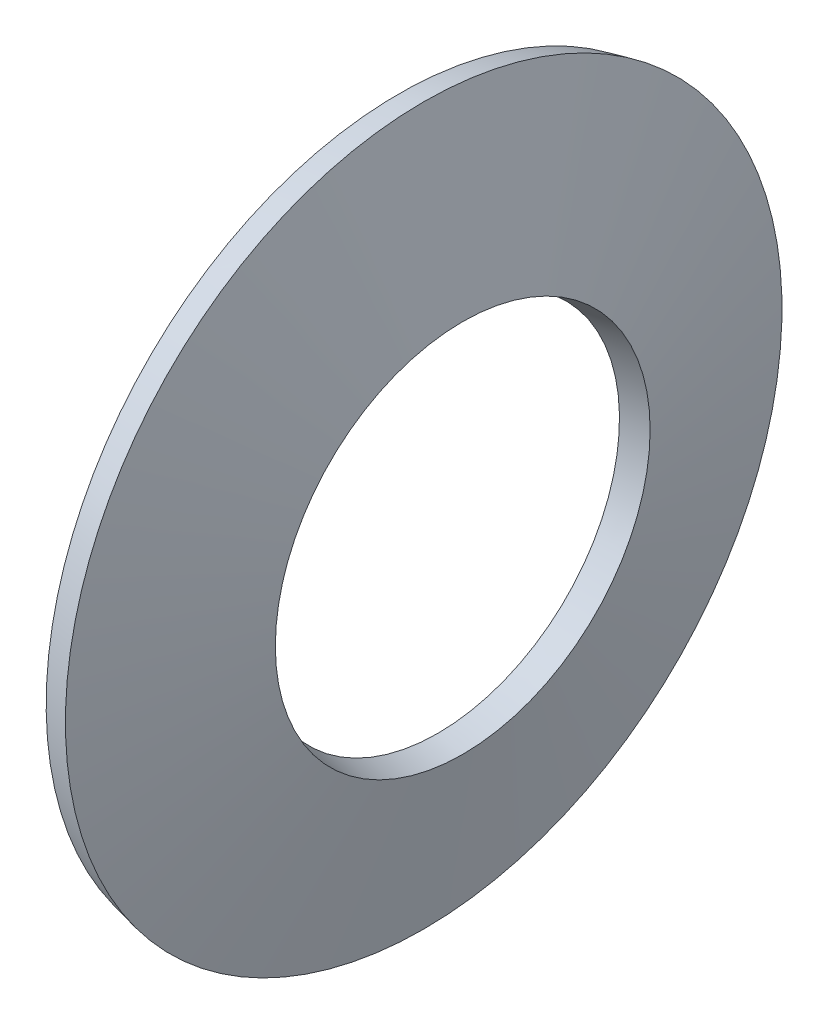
from build123d import *


with BuildPart() as part:
    # Esquisse2 → Base-R_volution (revolve)
    with BuildSketch(Plane.XY, mode=Mode.PRIVATE) as base_r_volution_sk:
        Polygon((0, 13.777333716), (1.525105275, 7.1), (2.5, 7.322666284), (0.974894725, 14), align=None)
    revolve(base_r_volution_sk.sketch.rotate(Axis((0, 0, 0), (1, 0, 0)), 180), axis=Axis((0, 0, 0), (1, 0, 0)))


solid = part.part
